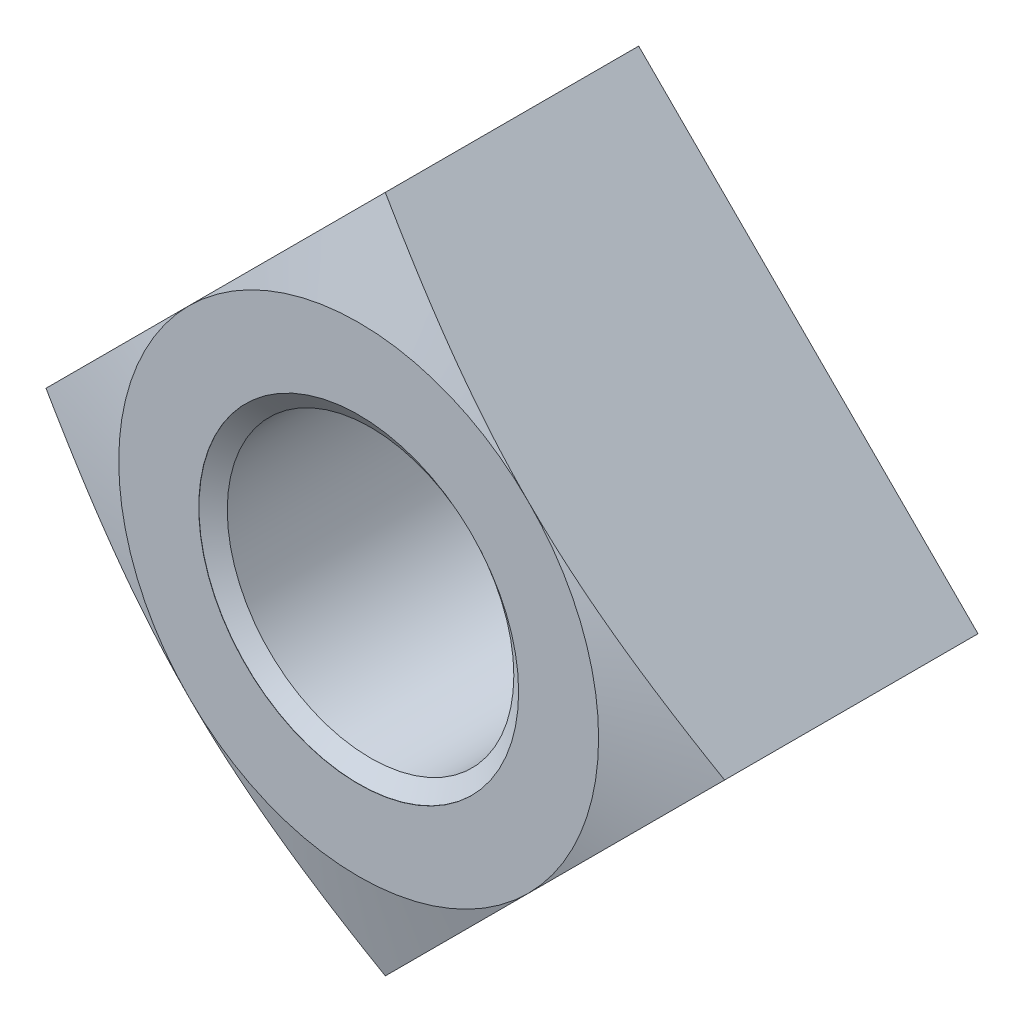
from build123d import *

# Parameters (mm, degrees)
BASENUT_START = -33.3502
BASENUTSKE_R  = 17.06626
BASENUT_DEPTH = 33.3502


with BuildPart() as part:
    # BaseNutSke → BaseNut (new body)
    with BuildSketch(Plane.XY.offset(BASENUT_START)):
        Polygon((40.411152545, 0), (0, 40.411152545), (-40.411152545, 0), (0, -40.411152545), align=None)
        Circle(BASENUTSKE_R, mode=Mode.SUBTRACT)
    extrude(amount=BASENUT_DEPTH)

    # EndChamferSketch → EndChamfer (revolve, cut)
    with BuildSketch(Plane(origin=(0, 0, 0), x_dir=(0, 0, -1), z_dir=(1, 0, 0)), mode=Mode.PRIVATE) as endchamfer_sk:
        Polygon((33.3248, 19.05), (31.797434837, 16.867886), (33.3502, 16.867886), (33.3502, 19.05), align=None)
        Polygon((0, 19.05), (0.0254, 19.05), (1.552765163, 16.867886), (0, 16.867886), align=None)
    revolve(endchamfer_sk.sketch.rotate(Axis((0, 0, -25.037505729), (0, 0, -1)), 90), axis=Axis((0, 0, -25.037505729), (0, 0, -1)), mode=Mode.SUBTRACT)

    # Sketch2 → Single-Chamfer (revolve, cut)
    with BuildSketch(Plane(origin=(0, 0, 0), x_dir=(0, 0, -1), z_dir=(1, 0, 0))):
        Polygon((-12.7, 28.575), (0, 28.575), (6.57444226, 53.111152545), (-12.7, 53.111152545), align=None)
    revolve(axis=Axis((0, 0, 0), (0, 0, -1)), mode=Mode.SUBTRACT)


solid = part.part
